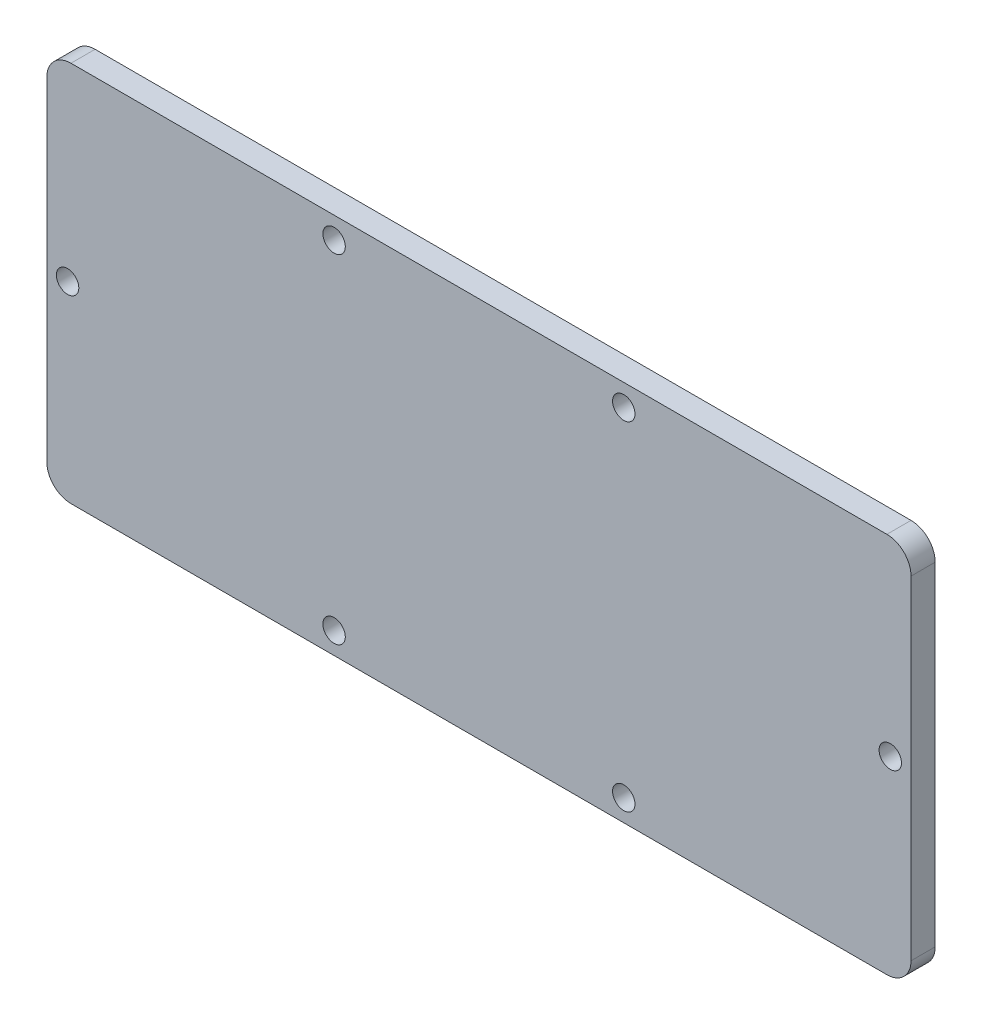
from build123d import *

# Parameters (mm, degrees)
BOSS_EXTRUDE1_DEPTH = 3.175
SKETCH2_R           = 1.4732
CUT_EXTRUDE1_DEPTH  = 63.202455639


with BuildPart() as part:
    # Sketch1 → Boss-Extrude1 (new body)
    with BuildSketch(Plane.XY):
        with BuildLine():
            Line((-53.6575, 25.0825), (53.6575, 25.0825))
            ThreePointArc((53.6575, 25.0825), (55.90256403, 24.15256403), (56.8325, 21.9075))
            Line((56.8325, 21.9075), (56.8325, -21.9075))
            ThreePointArc((56.8325, -21.9075), (55.90256403, -24.15256403), (53.6575, -25.0825))
            Line((53.6575, -25.0825), (-53.6575, -25.0825))
            ThreePointArc((-53.6575, -25.0825), (-55.90256403, -24.15256403), (-56.8325, -21.9075))
            Line((-56.8325, -21.9075), (-56.8325, 21.9075))
            ThreePointArc((-56.8325, 21.9075), (-55.90256403, 24.15256403), (-53.6575, 25.0825))
        make_face()
    extrude(amount=BOSS_EXTRUDE1_DEPTH)

    # Sketch2 → Cut-Extrude1 (cut, through all)
    with BuildSketch(Plane(origin=(0, 0, 0), x_dir=(-1, 0, 0), z_dir=(0, 0, -1))):
        with Locations((19.05, 22.225)):
            Circle(SKETCH2_R)
        with Locations((54.102, 0)):
            Circle(SKETCH2_R)
        with Locations((19.05, -22.225)):
            Circle(SKETCH2_R)
        with Locations((-19.05, 22.225)):
            Circle(SKETCH2_R)
        with Locations((-19.05, -22.225)):
            Circle(SKETCH2_R)
        with Locations((-54.102, 0)):
            Circle(SKETCH2_R)
    extrude(amount=-CUT_EXTRUDE1_DEPTH, mode=Mode.SUBTRACT)


solid = part.part
